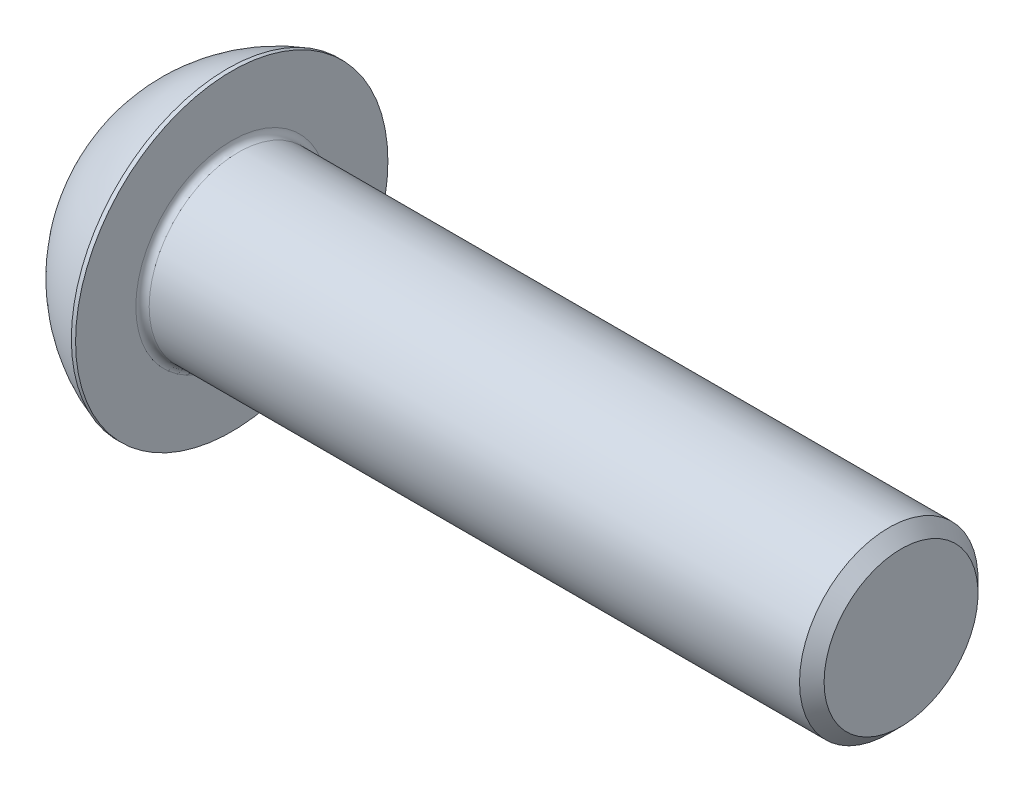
from build123d import *

# Parameters (mm, degrees)
FILLET1_R   = 0.6
HEX_2_DEPTH = 3.0988


with BuildPart() as part:
    # BodySke → BaseBody (revolve)
    with BuildSketch(Plane.XY, mode=Mode.PRIVATE) as basebody_sk:
        with BuildLine():
            Line((68.8, 0), (68.8, 6.8985))
            Line((68.8, 6.8985), (67.6985, 8))
            Line((67.6985, 8), (8.8, 8))
            Line((8.8, 8), (8.8, 14))
            Line((8.8, 14), (8.42, 14))
            ThreePointArc((8.42, 14), (3.53447189, 11.312563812), (0, 7))
            Line((0, 7), (0, 0))
            Line((0, 0), (68.8, 0))
        make_face()
    revolve(basebody_sk.sketch.rotate(Axis((0, 0, 0), (1, 0, 0)), 90), axis=Axis((0, 0, 0), (1, 0, 0)))

    # Fillet1
    fillet1_edges = [part.edges().sort_by_distance(p)[0] for p in [
        (8.8, 0, -8),
    ]]
    fillet(fillet1_edges, radius=FILLET1_R)

    # Sketch2 → PreBroach (revolve, cut)
    with BuildSketch(Plane.XY, mode=Mode.PRIVATE) as prebroach_sk:
        Polygon((0, 5), (3.0988, 5), (5.985551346, 0), (0, 0), align=None)
    revolve(prebroach_sk.sketch.rotate(Axis((0, 0, 0), (1, 0, 0)), 90), axis=Axis((0, 0, 0), (1, 0, 0)), mode=Mode.SUBTRACT)

    # Sketch3 → Hex 2 (cut)
    with BuildSketch(Plane(origin=(0, 0, 0), x_dir=(0, 0, -1), z_dir=(1, 0, 0))):
        Polygon((-5, -2.886751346), (-5, 2.886751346), (0, 5.773502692), (5, 2.886751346), (5, -2.886751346), (0, -5.773502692), align=None)
    extrude(amount=HEX_2_DEPTH, mode=Mode.SUBTRACT)


solid = part.part
